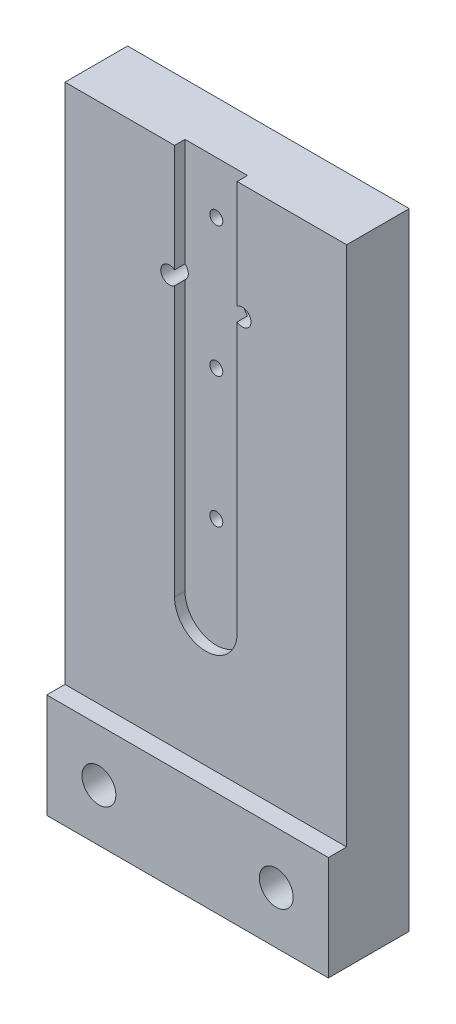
ISO-10303-21;
HEADER;
FILE_DESCRIPTION(('STEP AP214'),'2;1');
FILE_NAME('part.step','',(''),(''),'','','');
FILE_SCHEMA(('AUTOMOTIVE_DESIGN { 1 0 10303 214 1 1 1 1 }'));
ENDSEC;
DATA;
#1=APPLICATION_CONTEXT('core data for automotive mechanical design processes');
#2=APPLICATION_PROTOCOL_DEFINITION('international standard','automotive_design',2000,#1);
#3=PRODUCT_CONTEXT('',#1,'mechanical');
#4=PRODUCT('Part','Part','',(#3));
#5=PRODUCT_RELATED_PRODUCT_CATEGORY('part','',(#4));
#6=PRODUCT_DEFINITION_FORMATION('','',#4);
#7=PRODUCT_DEFINITION_CONTEXT('part definition',#1,'design');
#8=PRODUCT_DEFINITION('design','',#6,#7);
#9=PRODUCT_DEFINITION_SHAPE('','',#8);
#10=(LENGTH_UNIT() NAMED_UNIT(*) SI_UNIT(.MILLI.,.METRE.));
#11=(NAMED_UNIT(*) PLANE_ANGLE_UNIT() SI_UNIT($,.RADIAN.));
#12=(NAMED_UNIT(*) SI_UNIT($,.STERADIAN.) SOLID_ANGLE_UNIT());
#13=UNCERTAINTY_MEASURE_WITH_UNIT(LENGTH_MEASURE(1.E-05),#10,'distance_accuracy_value','');
#14=(GEOMETRIC_REPRESENTATION_CONTEXT(3) GLOBAL_UNCERTAINTY_ASSIGNED_CONTEXT((#13)) GLOBAL_UNIT_ASSIGNED_CONTEXT((#10,
#11,#12)) REPRESENTATION_CONTEXT('',''));
#15=CARTESIAN_POINT('',(0.,0.,0.));
#16=DIRECTION('',(0.,0.,1.));
#17=DIRECTION('',(1.,0.,0.));
#18=AXIS2_PLACEMENT_3D('',#15,#16,#17);
#19=CARTESIAN_POINT('',(27.,110.,15.5));
#20=DIRECTION('',(0.,0.,-1.));
#21=DIRECTION('',(-1.,0.,0.));
#22=AXIS2_PLACEMENT_3D('',#19,#20,#21);
#23=CYLINDRICAL_SURFACE('',#22,1.25);
#24=CARTESIAN_POINT('',(27.,110.,0.));
#25=DIRECTION('',(0.,0.,1.));
#26=DIRECTION('',(1.,0.,0.));
#27=AXIS2_PLACEMENT_3D('',#24,#25,#26);
#28=CIRCLE('',#27,1.25);
#29=CARTESIAN_POINT('',(28.25,110.,0.));
#30=VERTEX_POINT('',#29);
#31=EDGE_CURVE('E242',#30,#30,#28,.T.);
#32=ORIENTED_EDGE('',*,*,#31,.F.);
#33=EDGE_LOOP('',(#32));
#34=FACE_BOUND('',#33,.T.);
#35=CARTESIAN_POINT('',(27.,110.,10.));
#36=DIRECTION('',(0.,0.,1.));
#37=DIRECTION('',(1.,0.,0.));
#38=AXIS2_PLACEMENT_3D('',#35,#36,#37);
#39=CIRCLE('',#38,1.25);
#40=CARTESIAN_POINT('',(28.25,110.,10.));
#41=VERTEX_POINT('',#40);
#42=EDGE_CURVE('E193',#41,#41,#39,.T.);
#43=ORIENTED_EDGE('',*,*,#42,.T.);
#44=EDGE_LOOP('',(#43));
#45=FACE_BOUND('',#44,.T.);
#46=ADVANCED_FACE('F33',(#34,#45),#23,.F.);
#47=CARTESIAN_POINT('',(26.9999999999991,85.,15.5));
#48=DIRECTION('',(0.,0.,-1.));
#49=DIRECTION('',(-1.,0.,0.));
#50=AXIS2_PLACEMENT_3D('',#47,#48,#49);
#51=CYLINDRICAL_SURFACE('',#50,1.25);
#52=CARTESIAN_POINT('',(26.9999999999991,85.,0.));
#53=DIRECTION('',(0.,0.,1.));
#54=DIRECTION('',(1.,0.,0.));
#55=AXIS2_PLACEMENT_3D('',#52,#53,#54);
#56=CIRCLE('',#55,1.25);
#57=CARTESIAN_POINT('',(28.2499999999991,85.,0.));
#58=VERTEX_POINT('',#57);
#59=EDGE_CURVE('E239',#58,#58,#56,.T.);
#60=ORIENTED_EDGE('',*,*,#59,.F.);
#61=EDGE_LOOP('',(#60));
#62=FACE_BOUND('',#61,.T.);
#63=CARTESIAN_POINT('',(26.9999999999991,85.,10.));
#64=DIRECTION('',(0.,0.,1.));
#65=DIRECTION('',(1.,0.,0.));
#66=AXIS2_PLACEMENT_3D('',#63,#64,#65);
#67=CIRCLE('',#66,1.25);
#68=CARTESIAN_POINT('',(28.2499999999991,85.,10.));
#69=VERTEX_POINT('',#68);
#70=EDGE_CURVE('E190',#69,#69,#67,.T.);
#71=ORIENTED_EDGE('',*,*,#70,.T.);
#72=EDGE_LOOP('',(#71));
#73=FACE_BOUND('',#72,.T.);
#74=ADVANCED_FACE('F332',(#62,#73),#51,.F.);
#75=CARTESIAN_POINT('',(27.,60.,15.5));
#76=DIRECTION('',(0.,0.,-1.));
#77=DIRECTION('',(-1.,0.,0.));
#78=AXIS2_PLACEMENT_3D('',#75,#76,#77);
#79=CYLINDRICAL_SURFACE('',#78,1.25);
#80=CARTESIAN_POINT('',(27.,60.,0.));
#81=DIRECTION('',(0.,0.,1.));
#82=DIRECTION('',(1.,0.,0.));
#83=AXIS2_PLACEMENT_3D('',#80,#81,#82);
#84=CIRCLE('',#83,1.25);
#85=CARTESIAN_POINT('',(28.25,60.,0.));
#86=VERTEX_POINT('',#85);
#87=EDGE_CURVE('E234',#86,#86,#84,.T.);
#88=ORIENTED_EDGE('',*,*,#87,.F.);
#89=EDGE_LOOP('',(#88));
#90=FACE_BOUND('',#89,.T.);
#91=CARTESIAN_POINT('',(27.,60.,10.));
#92=DIRECTION('',(0.,0.,1.));
#93=DIRECTION('',(1.,0.,0.));
#94=AXIS2_PLACEMENT_3D('',#91,#92,#93);
#95=CIRCLE('',#94,1.25);
#96=CARTESIAN_POINT('',(28.25,60.,10.));
#97=VERTEX_POINT('',#96);
#98=EDGE_CURVE('E187',#97,#97,#95,.T.);
#99=ORIENTED_EDGE('',*,*,#98,.T.);
#100=EDGE_LOOP('',(#99));
#101=FACE_BOUND('',#100,.T.);
#102=ADVANCED_FACE('F325',(#90,#101),#79,.F.);
#103=CARTESIAN_POINT('',(0.,120.,15.5));
#104=DIRECTION('',(0.,0.,-1.));
#105=DIRECTION('',(-1.,0.,0.));
#106=AXIS2_PLACEMENT_3D('',#103,#104,#105);
#107=PLANE('',#106);
#108=CARTESIAN_POINT('',(44.,10.,15.5));
#109=DIRECTION('',(0.,0.,1.));
#110=DIRECTION('',(1.,0.,0.));
#111=AXIS2_PLACEMENT_3D('',#108,#109,#110);
#112=CIRCLE('',#111,3.25);
#113=CARTESIAN_POINT('',(47.25,10.,15.5));
#114=VERTEX_POINT('',#113);
#115=EDGE_CURVE('E225',#114,#114,#112,.T.);
#116=ORIENTED_EDGE('',*,*,#115,.F.);
#117=EDGE_LOOP('',(#116));
#118=FACE_BOUND('',#117,.T.);
#119=CARTESIAN_POINT('',(10.,10.,15.5));
#120=DIRECTION('',(0.,0.,1.));
#121=DIRECTION('',(1.,0.,0.));
#122=AXIS2_PLACEMENT_3D('',#119,#120,#121);
#123=CIRCLE('',#122,3.25);
#124=CARTESIAN_POINT('',(13.25,10.,15.5));
#125=VERTEX_POINT('',#124);
#126=EDGE_CURVE('E231',#125,#125,#123,.T.);
#127=ORIENTED_EDGE('',*,*,#126,.F.);
#128=EDGE_LOOP('',(#127));
#129=FACE_BOUND('',#128,.T.);
#130=DIRECTION('',(1.,0.,0.));
#131=VECTOR('',#130,1.);
#132=CARTESIAN_POINT('',(0.,20.,15.5));
#133=LINE('',#132,#131);
#134=CARTESIAN_POINT('',(0.,20.,15.5));
#135=VERTEX_POINT('',#134);
#136=CARTESIAN_POINT('',(54.,20.,15.5));
#137=VERTEX_POINT('',#136);
#138=EDGE_CURVE('E207',#135,#137,#133,.T.);
#139=ORIENTED_EDGE('',*,*,#138,.F.);
#140=DIRECTION('',(0.,-1.,0.));
#141=VECTOR('',#140,1.);
#142=CARTESIAN_POINT('',(0.,0.,15.5));
#143=LINE('',#142,#141);
#144=CARTESIAN_POINT('',(0.,0.,15.5));
#145=VERTEX_POINT('',#144);
#146=EDGE_CURVE('E246',#135,#145,#143,.T.);
#147=ORIENTED_EDGE('',*,*,#146,.T.);
#148=DIRECTION('',(1.,0.,0.));
#149=VECTOR('',#148,1.);
#150=CARTESIAN_POINT('',(0.,0.,15.5));
#151=LINE('',#150,#149);
#152=CARTESIAN_POINT('',(54.,0.,15.5));
#153=VERTEX_POINT('',#152);
#154=EDGE_CURVE('E248',#145,#153,#151,.T.);
#155=ORIENTED_EDGE('',*,*,#154,.T.);
#156=DIRECTION('',(0.,1.,0.));
#157=VECTOR('',#156,1.);
#158=CARTESIAN_POINT('',(54.,0.,15.5));
#159=LINE('',#158,#157);
#160=EDGE_CURVE('E251',#153,#137,#159,.T.);
#161=ORIENTED_EDGE('',*,*,#160,.T.);
#162=EDGE_LOOP('',(#139,#147,#155,#161));
#163=FACE_BOUND('',#162,.T.);
#164=ADVANCED_FACE('F323',(#118,#129,#163),#107,.F.);
#165=CARTESIAN_POINT('',(0.,0.,15.5));
#166=DIRECTION('',(1.,0.,0.));
#167=DIRECTION('',(0.,0.,-1.));
#168=AXIS2_PLACEMENT_3D('',#165,#166,#167);
#169=PLANE('',#168);
#170=DIRECTION('',(0.,0.,1.));
#171=VECTOR('',#170,1.);
#172=CARTESIAN_POINT('',(0.,20.,15.5));
#173=LINE('',#172,#171);
#174=CARTESIAN_POINT('',(0.,20.,12.));
#175=VERTEX_POINT('',#174);
#176=EDGE_CURVE('E200',#175,#135,#173,.T.);
#177=ORIENTED_EDGE('',*,*,#176,.F.);
#178=DIRECTION('',(0.,-1.,0.));
#179=VECTOR('',#178,1.);
#180=CARTESIAN_POINT('',(0.,20.,12.));
#181=LINE('',#180,#179);
#182=CARTESIAN_POINT('',(0.,120.,12.));
#183=VERTEX_POINT('',#182);
#184=EDGE_CURVE('E197',#183,#175,#181,.T.);
#185=ORIENTED_EDGE('',*,*,#184,.F.);
#186=DIRECTION('',(0.,0.,-1.));
#187=VECTOR('',#186,1.);
#188=CARTESIAN_POINT('',(0.,120.,15.5));
#189=LINE('',#188,#187);
#190=CARTESIAN_POINT('',(0.,120.,0.));
#191=VERTEX_POINT('',#190);
#192=EDGE_CURVE('E254',#183,#191,#189,.T.);
#193=ORIENTED_EDGE('',*,*,#192,.T.);
#194=DIRECTION('',(0.,-1.,0.));
#195=VECTOR('',#194,1.);
#196=CARTESIAN_POINT('',(0.,0.,0.));
#197=LINE('',#196,#195);
#198=CARTESIAN_POINT('',(0.,0.,0.));
#199=VERTEX_POINT('',#198);
#200=EDGE_CURVE('E245',#191,#199,#197,.T.);
#201=ORIENTED_EDGE('',*,*,#200,.T.);
#202=DIRECTION('',(0.,0.,-1.));
#203=VECTOR('',#202,1.);
#204=CARTESIAN_POINT('',(0.,0.,15.5));
#205=LINE('',#204,#203);
#206=EDGE_CURVE('E270',#145,#199,#205,.T.);
#207=ORIENTED_EDGE('',*,*,#206,.F.);
#208=ORIENTED_EDGE('',*,*,#146,.F.);
#209=EDGE_LOOP('',(#177,#185,#193,#201,#207,#208));
#210=FACE_BOUND('',#209,.T.);
#211=ADVANCED_FACE('F35',(#210),#169,.F.);
#212=CARTESIAN_POINT('',(54.,0.,15.5));
#213=DIRECTION('',(-1.,0.,0.));
#214=DIRECTION('',(0.,0.,1.));
#215=AXIS2_PLACEMENT_3D('',#212,#213,#214);
#216=PLANE('',#215);
#217=DIRECTION('',(0.,0.,1.));
#218=VECTOR('',#217,1.);
#219=CARTESIAN_POINT('',(54.,20.,15.5));
#220=LINE('',#219,#218);
#221=CARTESIAN_POINT('',(54.,20.,12.));
#222=VERTEX_POINT('',#221);
#223=EDGE_CURVE('E201',#222,#137,#220,.T.);
#224=ORIENTED_EDGE('',*,*,#223,.T.);
#225=ORIENTED_EDGE('',*,*,#160,.F.);
#226=DIRECTION('',(0.,0.,-1.));
#227=VECTOR('',#226,1.);
#228=CARTESIAN_POINT('',(54.,0.,15.5));
#229=LINE('',#228,#227);
#230=CARTESIAN_POINT('',(54.,0.,0.));
#231=VERTEX_POINT('',#230);
#232=EDGE_CURVE('E267',#153,#231,#229,.T.);
#233=ORIENTED_EDGE('',*,*,#232,.T.);
#234=DIRECTION('',(0.,1.,0.));
#235=VECTOR('',#234,1.);
#236=CARTESIAN_POINT('',(54.,0.,0.));
#237=LINE('',#236,#235);
#238=CARTESIAN_POINT('',(54.,120.,0.));
#239=VERTEX_POINT('',#238);
#240=EDGE_CURVE('E259',#231,#239,#237,.T.);
#241=ORIENTED_EDGE('',*,*,#240,.T.);
#242=DIRECTION('',(0.,0.,-1.));
#243=VECTOR('',#242,1.);
#244=CARTESIAN_POINT('',(54.,120.,15.5));
#245=LINE('',#244,#243);
#246=CARTESIAN_POINT('',(54.,120.,12.));
#247=VERTEX_POINT('',#246);
#248=EDGE_CURVE('E265',#247,#239,#245,.T.);
#249=ORIENTED_EDGE('',*,*,#248,.F.);
#250=DIRECTION('',(0.,-1.,0.));
#251=VECTOR('',#250,1.);
#252=CARTESIAN_POINT('',(54.,20.,12.));
#253=LINE('',#252,#251);
#254=EDGE_CURVE('E196',#247,#222,#253,.T.);
#255=ORIENTED_EDGE('',*,*,#254,.T.);
#256=EDGE_LOOP('',(#224,#225,#233,#241,#249,#255));
#257=FACE_BOUND('',#256,.T.);
#258=ADVANCED_FACE('F313',(#257),#216,.F.);
#259=CARTESIAN_POINT('',(0.,120.,15.5));
#260=DIRECTION('',(0.,-1.,0.));
#261=DIRECTION('',(0.,0.,-1.));
#262=AXIS2_PLACEMENT_3D('',#259,#260,#261);
#263=PLANE('',#262);
#264=DIRECTION('',(1.,0.,0.));
#265=VECTOR('',#264,1.);
#266=CARTESIAN_POINT('',(0.,120.,12.));
#267=LINE('',#266,#265);
#268=CARTESIAN_POINT('',(21.,120.,12.));
#269=VERTEX_POINT('',#268);
#270=EDGE_CURVE('E212',#183,#269,#267,.T.);
#271=ORIENTED_EDGE('',*,*,#270,.T.);
#272=DIRECTION('',(0.,0.,1.));
#273=VECTOR('',#272,1.);
#274=CARTESIAN_POINT('',(21.,120.,10.));
#275=LINE('',#274,#273);
#276=CARTESIAN_POINT('',(21.,120.,10.));
#277=VERTEX_POINT('',#276);
#278=EDGE_CURVE('E175',#277,#269,#275,.T.);
#279=ORIENTED_EDGE('',*,*,#278,.F.);
#280=DIRECTION('',(-1.,0.,0.));
#281=VECTOR('',#280,1.);
#282=CARTESIAN_POINT('',(21.,120.,10.));
#283=LINE('',#282,#281);
#284=CARTESIAN_POINT('',(33.,120.,10.));
#285=VERTEX_POINT('',#284);
#286=EDGE_CURVE('E155',#285,#277,#283,.T.);
#287=ORIENTED_EDGE('',*,*,#286,.F.);
#288=DIRECTION('',(0.,0.,1.));
#289=VECTOR('',#288,1.);
#290=CARTESIAN_POINT('',(33.,120.,10.));
#291=LINE('',#290,#289);
#292=CARTESIAN_POINT('',(33.,120.,12.));
#293=VERTEX_POINT('',#292);
#294=EDGE_CURVE('E146',#285,#293,#291,.T.);
#295=ORIENTED_EDGE('',*,*,#294,.T.);
#296=EDGE_CURVE('E56',#293,#247,#267,.T.);
#297=ORIENTED_EDGE('',*,*,#296,.T.);
#298=ORIENTED_EDGE('',*,*,#248,.T.);
#299=DIRECTION('',(-1.,0.,0.));
#300=VECTOR('',#299,1.);
#301=CARTESIAN_POINT('',(0.,120.,0.));
#302=LINE('',#301,#300);
#303=EDGE_CURVE('E249',#239,#191,#302,.T.);
#304=ORIENTED_EDGE('',*,*,#303,.T.);
#305=ORIENTED_EDGE('',*,*,#192,.F.);
#306=EDGE_LOOP('',(#271,#279,#287,#295,#297,#298,#304,#305));
#307=FACE_BOUND('',#306,.T.);
#308=ADVANCED_FACE('F292',(#307),#263,.F.);
#309=CARTESIAN_POINT('',(20.,98.,15.5));
#310=DIRECTION('',(0.,0.,-1.));
#311=DIRECTION('',(-1.,0.,0.));
#312=AXIS2_PLACEMENT_3D('',#309,#310,#311);
#313=CYLINDRICAL_SURFACE('',#312,1.65);
#314=DIRECTION('',(0.,0.,-1.));
#315=VECTOR('',#314,1.);
#316=CARTESIAN_POINT('',(21.0000000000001,99.3124404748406,15.5));
#317=LINE('',#316,#315);
#318=CARTESIAN_POINT('',(21.0000000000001,99.3124404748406,12.));
#319=VERTEX_POINT('',#318);
#320=CARTESIAN_POINT('',(20.9999999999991,99.3124404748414,10.));
#321=VERTEX_POINT('',#320);
#322=EDGE_CURVE('E182',#319,#321,#317,.T.);
#323=ORIENTED_EDGE('',*,*,#322,.F.);
#324=CARTESIAN_POINT('',(20.,98.,12.));
#325=DIRECTION('',(0.,0.,1.));
#326=DIRECTION('',(1.,0.,0.));
#327=AXIS2_PLACEMENT_3D('',#324,#325,#326);
#328=CIRCLE('',#327,1.65);
#329=CARTESIAN_POINT('',(21.,96.6875595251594,12.));
#330=VERTEX_POINT('',#329);
#331=EDGE_CURVE('E215',#319,#330,#328,.T.);
#332=ORIENTED_EDGE('',*,*,#331,.T.);
#333=DIRECTION('',(0.,0.,-1.));
#334=VECTOR('',#333,1.);
#335=CARTESIAN_POINT('',(21.,96.6875595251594,15.5));
#336=LINE('',#335,#334);
#337=CARTESIAN_POINT('',(20.999999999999,96.6875595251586,10.));
#338=VERTEX_POINT('',#337);
#339=EDGE_CURVE('E180',#338,#330,#336,.F.);
#340=ORIENTED_EDGE('',*,*,#339,.F.);
#341=CARTESIAN_POINT('',(20.,98.,10.));
#342=DIRECTION('',(0.,0.,1.));
#343=DIRECTION('',(1.,0.,0.));
#344=AXIS2_PLACEMENT_3D('',#341,#342,#343);
#345=CIRCLE('',#344,1.65);
#346=EDGE_CURVE('E184',#338,#321,#345,.T.);
#347=ORIENTED_EDGE('',*,*,#346,.T.);
#348=EDGE_LOOP('',(#323,#332,#340,#347));
#349=FACE_BOUND('',#348,.T.);
#350=CARTESIAN_POINT('',(20.,98.,0.));
#351=DIRECTION('',(0.,0.,1.));
#352=DIRECTION('',(1.,0.,0.));
#353=AXIS2_PLACEMENT_3D('',#350,#351,#352);
#354=CIRCLE('',#353,1.65);
#355=CARTESIAN_POINT('',(21.65,98.,0.));
#356=VERTEX_POINT('',#355);
#357=EDGE_CURVE('E221',#356,#356,#354,.T.);
#358=ORIENTED_EDGE('',*,*,#357,.F.);
#359=EDGE_LOOP('',(#358));
#360=FACE_BOUND('',#359,.T.);
#361=ADVANCED_FACE('F296',(#349,#360),#313,.F.);
#362=CARTESIAN_POINT('',(34.,98.,15.5));
#363=DIRECTION('',(0.,0.,-1.));
#364=DIRECTION('',(-1.,0.,0.));
#365=AXIS2_PLACEMENT_3D('',#362,#363,#364);
#366=CYLINDRICAL_SURFACE('',#365,1.65);
#367=DIRECTION('',(0.,0.,-1.));
#368=VECTOR('',#367,1.);
#369=CARTESIAN_POINT('',(32.999999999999,96.6875595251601,15.5));
#370=LINE('',#369,#368);
#371=CARTESIAN_POINT('',(32.999999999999,96.6875595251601,12.));
#372=VERTEX_POINT('',#371);
#373=CARTESIAN_POINT('',(33.,96.6875595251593,10.));
#374=VERTEX_POINT('',#373);
#375=EDGE_CURVE('E153',#372,#374,#370,.T.);
#376=ORIENTED_EDGE('',*,*,#375,.F.);
#377=CARTESIAN_POINT('',(34.,98.,12.));
#378=DIRECTION('',(0.,0.,1.));
#379=DIRECTION('',(1.,0.,0.));
#380=AXIS2_PLACEMENT_3D('',#377,#378,#379);
#381=CIRCLE('',#380,1.65);
#382=CARTESIAN_POINT('',(32.9999999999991,99.31244047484,12.));
#383=VERTEX_POINT('',#382);
#384=EDGE_CURVE('E209',#372,#383,#381,.T.);
#385=ORIENTED_EDGE('',*,*,#384,.T.);
#386=DIRECTION('',(0.,0.,-1.));
#387=VECTOR('',#386,1.);
#388=CARTESIAN_POINT('',(32.9999999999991,99.31244047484,15.5));
#389=LINE('',#388,#387);
#390=CARTESIAN_POINT('',(33.,99.3124404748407,10.));
#391=VERTEX_POINT('',#390);
#392=EDGE_CURVE('E48',#391,#383,#389,.F.);
#393=ORIENTED_EDGE('',*,*,#392,.F.);
#394=CARTESIAN_POINT('',(34.,98.,10.));
#395=DIRECTION('',(0.,0.,1.));
#396=DIRECTION('',(1.,0.,0.));
#397=AXIS2_PLACEMENT_3D('',#394,#395,#396);
#398=CIRCLE('',#397,1.65);
#399=EDGE_CURVE('E12',#391,#374,#398,.T.);
#400=ORIENTED_EDGE('',*,*,#399,.T.);
#401=EDGE_LOOP('',(#376,#385,#393,#400));
#402=FACE_BOUND('',#401,.T.);
#403=CARTESIAN_POINT('',(34.,98.,0.));
#404=DIRECTION('',(0.,0.,1.));
#405=DIRECTION('',(1.,0.,0.));
#406=AXIS2_PLACEMENT_3D('',#403,#404,#405);
#407=CIRCLE('',#406,1.65);
#408=CARTESIAN_POINT('',(35.65,98.,0.));
#409=VERTEX_POINT('',#408);
#410=EDGE_CURVE('E218',#409,#409,#407,.T.);
#411=ORIENTED_EDGE('',*,*,#410,.F.);
#412=EDGE_LOOP('',(#411));
#413=FACE_BOUND('',#412,.T.);
#414=ADVANCED_FACE('F286',(#402,#413),#366,.F.);
#415=CARTESIAN_POINT('',(0.,120.,0.));
#416=DIRECTION('',(0.,0.,-1.));
#417=DIRECTION('',(-1.,0.,0.));
#418=AXIS2_PLACEMENT_3D('',#415,#416,#417);
#419=PLANE('',#418);
#420=ORIENTED_EDGE('',*,*,#357,.T.);
#421=EDGE_LOOP('',(#420));
#422=FACE_BOUND('',#421,.T.);
#423=CARTESIAN_POINT('',(10.,10.,0.));
#424=DIRECTION('',(0.,0.,1.));
#425=DIRECTION('',(1.,0.,0.));
#426=AXIS2_PLACEMENT_3D('',#423,#424,#425);
#427=CIRCLE('',#426,3.25);
#428=CARTESIAN_POINT('',(13.25,10.,0.));
#429=VERTEX_POINT('',#428);
#430=EDGE_CURVE('E228',#429,#429,#427,.T.);
#431=ORIENTED_EDGE('',*,*,#430,.T.);
#432=EDGE_LOOP('',(#431));
#433=FACE_BOUND('',#432,.T.);
#434=ORIENTED_EDGE('',*,*,#59,.T.);
#435=EDGE_LOOP('',(#434));
#436=FACE_BOUND('',#435,.T.);
#437=ORIENTED_EDGE('',*,*,#200,.F.);
#438=ORIENTED_EDGE('',*,*,#303,.F.);
#439=ORIENTED_EDGE('',*,*,#240,.F.);
#440=DIRECTION('',(1.,0.,0.));
#441=VECTOR('',#440,1.);
#442=CARTESIAN_POINT('',(0.,0.,0.));
#443=LINE('',#442,#441);
#444=EDGE_CURVE('E257',#199,#231,#443,.T.);
#445=ORIENTED_EDGE('',*,*,#444,.F.);
#446=EDGE_LOOP('',(#437,#438,#439,#445));
#447=FACE_BOUND('',#446,.T.);
#448=ORIENTED_EDGE('',*,*,#31,.T.);
#449=EDGE_LOOP('',(#448));
#450=FACE_BOUND('',#449,.T.);
#451=ORIENTED_EDGE('',*,*,#87,.T.);
#452=EDGE_LOOP('',(#451));
#453=FACE_BOUND('',#452,.T.);
#454=CARTESIAN_POINT('',(44.,10.,0.));
#455=DIRECTION('',(0.,0.,1.));
#456=DIRECTION('',(1.,0.,0.));
#457=AXIS2_PLACEMENT_3D('',#454,#455,#456);
#458=CIRCLE('',#457,3.25);
#459=CARTESIAN_POINT('',(47.25,10.,0.));
#460=VERTEX_POINT('',#459);
#461=EDGE_CURVE('E224',#460,#460,#458,.T.);
#462=ORIENTED_EDGE('',*,*,#461,.T.);
#463=EDGE_LOOP('',(#462));
#464=FACE_BOUND('',#463,.T.);
#465=ORIENTED_EDGE('',*,*,#410,.T.);
#466=EDGE_LOOP('',(#465));
#467=FACE_BOUND('',#466,.T.);
#468=ADVANCED_FACE('F317',(#422,#433,#436,#447,#450,#453,#464,#467),#419,.T.);
#469=CARTESIAN_POINT('',(0.,0.,15.5));
#470=DIRECTION('',(0.,1.,0.));
#471=DIRECTION('',(0.,0.,1.));
#472=AXIS2_PLACEMENT_3D('',#469,#470,#471);
#473=PLANE('',#472);
#474=ORIENTED_EDGE('',*,*,#444,.T.);
#475=ORIENTED_EDGE('',*,*,#232,.F.);
#476=ORIENTED_EDGE('',*,*,#154,.F.);
#477=ORIENTED_EDGE('',*,*,#206,.T.);
#478=EDGE_LOOP('',(#474,#475,#476,#477));
#479=FACE_BOUND('',#478,.T.);
#480=ADVANCED_FACE('F321',(#479),#473,.F.);
#481=CARTESIAN_POINT('',(10.,10.,15.5));
#482=DIRECTION('',(0.,0.,-1.));
#483=DIRECTION('',(-1.,0.,0.));
#484=AXIS2_PLACEMENT_3D('',#481,#482,#483);
#485=CYLINDRICAL_SURFACE('',#484,3.25);
#486=ORIENTED_EDGE('',*,*,#126,.T.);
#487=EDGE_LOOP('',(#486));
#488=FACE_BOUND('',#487,.T.);
#489=ORIENTED_EDGE('',*,*,#430,.F.);
#490=EDGE_LOOP('',(#489));
#491=FACE_BOUND('',#490,.T.);
#492=ADVANCED_FACE('F349',(#488,#491),#485,.F.);
#493=CARTESIAN_POINT('',(44.,10.,15.5));
#494=DIRECTION('',(0.,0.,-1.));
#495=DIRECTION('',(-1.,0.,0.));
#496=AXIS2_PLACEMENT_3D('',#493,#494,#495);
#497=CYLINDRICAL_SURFACE('',#496,3.25);
#498=ORIENTED_EDGE('',*,*,#115,.T.);
#499=EDGE_LOOP('',(#498));
#500=FACE_BOUND('',#499,.T.);
#501=ORIENTED_EDGE('',*,*,#461,.F.);
#502=EDGE_LOOP('',(#501));
#503=FACE_BOUND('',#502,.T.);
#504=ADVANCED_FACE('F352',(#500,#503),#497,.F.);
#505=CARTESIAN_POINT('',(0.,20.,15.5));
#506=DIRECTION('',(0.,1.,0.));
#507=DIRECTION('',(0.,0.,1.));
#508=AXIS2_PLACEMENT_3D('',#505,#506,#507);
#509=PLANE('',#508);
#510=ORIENTED_EDGE('',*,*,#223,.F.);
#511=DIRECTION('',(1.,0.,0.));
#512=VECTOR('',#511,1.);
#513=CARTESIAN_POINT('',(0.,20.,12.));
#514=LINE('',#513,#512);
#515=EDGE_CURVE('E210',#175,#222,#514,.T.);
#516=ORIENTED_EDGE('',*,*,#515,.F.);
#517=ORIENTED_EDGE('',*,*,#176,.T.);
#518=ORIENTED_EDGE('',*,*,#138,.T.);
#519=EDGE_LOOP('',(#510,#516,#517,#518));
#520=FACE_BOUND('',#519,.T.);
#521=ADVANCED_FACE('F309',(#520),#509,.T.);
#522=CARTESIAN_POINT('',(0.,20.,12.));
#523=DIRECTION('',(0.,0.,1.));
#524=DIRECTION('',(1.,0.,0.));
#525=AXIS2_PLACEMENT_3D('',#522,#523,#524);
#526=PLANE('',#525);
#527=DIRECTION('',(0.,-1.,0.));
#528=VECTOR('',#527,1.);
#529=CARTESIAN_POINT('',(20.9999999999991,45.,12.));
#530=LINE('',#529,#528);
#531=EDGE_CURVE('E162',#269,#319,#530,.T.);
#532=ORIENTED_EDGE('',*,*,#531,.F.);
#533=ORIENTED_EDGE('',*,*,#270,.F.);
#534=ORIENTED_EDGE('',*,*,#184,.T.);
#535=ORIENTED_EDGE('',*,*,#515,.T.);
#536=ORIENTED_EDGE('',*,*,#254,.F.);
#537=ORIENTED_EDGE('',*,*,#296,.F.);
#538=DIRECTION('',(0.,1.,0.));
#539=VECTOR('',#538,1.);
#540=CARTESIAN_POINT('',(32.9999999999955,19.9999999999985,12.));
#541=LINE('',#540,#539);
#542=EDGE_CURVE('E273',#383,#293,#541,.T.);
#543=ORIENTED_EDGE('',*,*,#542,.F.);
#544=ORIENTED_EDGE('',*,*,#384,.F.);
#545=DIRECTION('',(0.,1.,0.));
#546=VECTOR('',#545,1.);
#547=CARTESIAN_POINT('',(32.9999999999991,99.7320508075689,12.));
#548=LINE('',#547,#546);
#549=CARTESIAN_POINT('',(32.9999999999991,45.,12.));
#550=VERTEX_POINT('',#549);
#551=EDGE_CURVE('E164',#550,#372,#548,.T.);
#552=ORIENTED_EDGE('',*,*,#551,.F.);
#553=CARTESIAN_POINT('',(27.,45.,12.));
#554=DIRECTION('',(0.,0.,1.));
#555=DIRECTION('',(1.,0.,0.));
#556=AXIS2_PLACEMENT_3D('',#553,#554,#555);
#557=CIRCLE('',#556,6.);
#558=CARTESIAN_POINT('',(20.9999999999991,45.,12.));
#559=VERTEX_POINT('',#558);
#560=EDGE_CURVE('E143',#559,#550,#557,.T.);
#561=ORIENTED_EDGE('',*,*,#560,.F.);
#562=DIRECTION('',(0.,-1.,0.));
#563=VECTOR('',#562,1.);
#564=CARTESIAN_POINT('',(20.9999999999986,19.9999999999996,12.));
#565=LINE('',#564,#563);
#566=EDGE_CURVE('E41',#330,#559,#565,.T.);
#567=ORIENTED_EDGE('',*,*,#566,.F.);
#568=ORIENTED_EDGE('',*,*,#331,.F.);
#569=EDGE_LOOP('',(#532,#533,#534,#535,#536,#537,#543,#544,#552,#561,#567,#568));
#570=FACE_BOUND('',#569,.T.);
#571=ADVANCED_FACE('F283',(#570),#526,.T.);
#572=CARTESIAN_POINT('',(20.9999999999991,45.,10.));
#573=DIRECTION('',(-1.,0.,0.));
#574=DIRECTION('',(0.,-1.,0.));
#575=AXIS2_PLACEMENT_3D('',#572,#573,#574);
#576=PLANE('',#575);
#577=ORIENTED_EDGE('',*,*,#322,.T.);
#578=DIRECTION('',(0.,-1.,0.));
#579=VECTOR('',#578,1.);
#580=CARTESIAN_POINT('',(20.9999999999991,99.3124404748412,10.));
#581=LINE('',#580,#579);
#582=EDGE_CURVE('E147',#277,#321,#581,.T.);
#583=ORIENTED_EDGE('',*,*,#582,.F.);
#584=ORIENTED_EDGE('',*,*,#278,.T.);
#585=ORIENTED_EDGE('',*,*,#531,.T.);
#586=EDGE_LOOP('',(#577,#583,#584,#585));
#587=FACE_BOUND('',#586,.T.);
#588=ADVANCED_FACE('F363',(#587),#576,.F.);
#589=CARTESIAN_POINT('',(32.9999999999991,99.7320508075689,10.));
#590=DIRECTION('',(1.,0.,0.));
#591=DIRECTION('',(0.,1.,0.));
#592=AXIS2_PLACEMENT_3D('',#589,#590,#591);
#593=PLANE('',#592);
#594=ORIENTED_EDGE('',*,*,#375,.T.);
#595=DIRECTION('',(0.,1.,0.));
#596=VECTOR('',#595,1.);
#597=CARTESIAN_POINT('',(32.9999999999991,45.,10.));
#598=LINE('',#597,#596);
#599=CARTESIAN_POINT('',(32.9999999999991,45.,10.));
#600=VERTEX_POINT('',#599);
#601=EDGE_CURVE('E150',#600,#374,#598,.T.);
#602=ORIENTED_EDGE('',*,*,#601,.F.);
#603=DIRECTION('',(0.,0.,1.));
#604=VECTOR('',#603,1.);
#605=CARTESIAN_POINT('',(32.9999999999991,45.,10.));
#606=LINE('',#605,#604);
#607=EDGE_CURVE('E136',#600,#550,#606,.T.);
#608=ORIENTED_EDGE('',*,*,#607,.T.);
#609=ORIENTED_EDGE('',*,*,#551,.T.);
#610=EDGE_LOOP('',(#594,#602,#608,#609));
#611=FACE_BOUND('',#610,.T.);
#612=ADVANCED_FACE('F151',(#611),#593,.F.);
#613=CARTESIAN_POINT('',(27.,45.,10.));
#614=DIRECTION('',(0.,0.,1.));
#615=DIRECTION('',(1.,0.,0.));
#616=AXIS2_PLACEMENT_3D('',#613,#614,#615);
#617=CYLINDRICAL_SURFACE('',#616,6.);
#618=ORIENTED_EDGE('',*,*,#560,.T.);
#619=ORIENTED_EDGE('',*,*,#607,.F.);
#620=CARTESIAN_POINT('',(27.,45.,10.));
#621=DIRECTION('',(0.,0.,1.));
#622=DIRECTION('',(1.,0.,0.));
#623=AXIS2_PLACEMENT_3D('',#620,#621,#622);
#624=CIRCLE('',#623,6.);
#625=CARTESIAN_POINT('',(20.9999999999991,45.,10.));
#626=VERTEX_POINT('',#625);
#627=EDGE_CURVE('E141',#626,#600,#624,.T.);
#628=ORIENTED_EDGE('',*,*,#627,.F.);
#629=DIRECTION('',(0.,0.,1.));
#630=VECTOR('',#629,1.);
#631=CARTESIAN_POINT('',(20.9999999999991,45.,10.));
#632=LINE('',#631,#630);
#633=EDGE_CURVE('E173',#626,#559,#632,.T.);
#634=ORIENTED_EDGE('',*,*,#633,.T.);
#635=EDGE_LOOP('',(#618,#619,#628,#634));
#636=FACE_BOUND('',#635,.T.);
#637=ADVANCED_FACE('F138',(#636),#617,.F.);
#638=ORIENTED_EDGE('',*,*,#339,.T.);
#639=ORIENTED_EDGE('',*,*,#566,.T.);
#640=ORIENTED_EDGE('',*,*,#633,.F.);
#641=EDGE_CURVE('E160',#338,#626,#581,.T.);
#642=ORIENTED_EDGE('',*,*,#641,.F.);
#643=EDGE_LOOP('',(#638,#639,#640,#642));
#644=FACE_BOUND('',#643,.T.);
#645=ADVANCED_FACE('F278',(#644),#576,.F.);
#646=ORIENTED_EDGE('',*,*,#392,.T.);
#647=ORIENTED_EDGE('',*,*,#542,.T.);
#648=ORIENTED_EDGE('',*,*,#294,.F.);
#649=EDGE_CURVE('E156',#391,#285,#598,.T.);
#650=ORIENTED_EDGE('',*,*,#649,.F.);
#651=EDGE_LOOP('',(#646,#647,#648,#650));
#652=FACE_BOUND('',#651,.T.);
#653=ADVANCED_FACE('F289',(#652),#593,.F.);
#654=CARTESIAN_POINT('',(27.,45.,10.));
#655=DIRECTION('',(0.,0.,1.));
#656=DIRECTION('',(1.,0.,0.));
#657=AXIS2_PLACEMENT_3D('',#654,#655,#656);
#658=PLANE('',#657);
#659=ORIENTED_EDGE('',*,*,#42,.F.);
#660=EDGE_LOOP('',(#659));
#661=FACE_BOUND('',#660,.T.);
#662=ORIENTED_EDGE('',*,*,#70,.F.);
#663=EDGE_LOOP('',(#662));
#664=FACE_BOUND('',#663,.T.);
#665=ORIENTED_EDGE('',*,*,#98,.F.);
#666=EDGE_LOOP('',(#665));
#667=FACE_BOUND('',#666,.T.);
#668=ORIENTED_EDGE('',*,*,#641,.T.);
#669=ORIENTED_EDGE('',*,*,#627,.T.);
#670=ORIENTED_EDGE('',*,*,#601,.T.);
#671=ORIENTED_EDGE('',*,*,#399,.F.);
#672=ORIENTED_EDGE('',*,*,#649,.T.);
#673=ORIENTED_EDGE('',*,*,#286,.T.);
#674=ORIENTED_EDGE('',*,*,#582,.T.);
#675=ORIENTED_EDGE('',*,*,#346,.F.);
#676=EDGE_LOOP('',(#668,#669,#670,#671,#672,#673,#674,#675));
#677=FACE_BOUND('',#676,.T.);
#678=ADVANCED_FACE('F158',(#661,#664,#667,#677),#658,.T.);
#679=CLOSED_SHELL('',(#46,#74,#102,#164,#211,#258,#308,#361,#414,#468,#480,#492,#504,#521,#571,
#588,#612,#637,#645,#653,#678));
#680=MANIFOLD_SOLID_BREP('B2',#679);
#681=ADVANCED_BREP_SHAPE_REPRESENTATION('',(#18,#680),#14);
#682=SHAPE_DEFINITION_REPRESENTATION(#9,#681);
ENDSEC;
END-ISO-10303-21;
